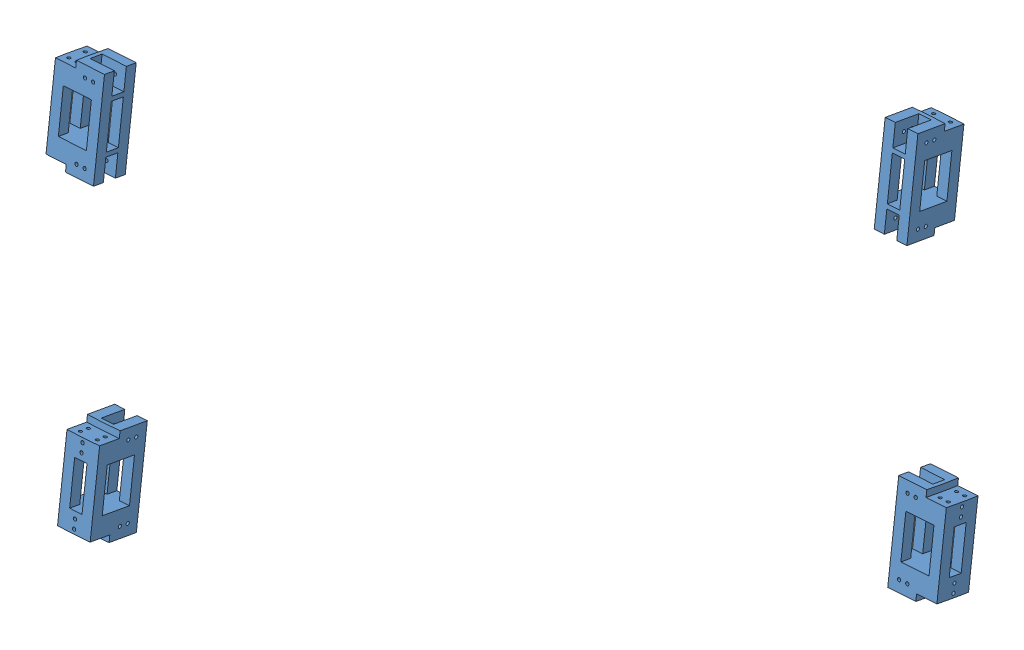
SolidWorks assembly SnapThroughAss_Circle.SLDASM, configuration Flap Out (file format 15000). Lengths in mm.
Overall size (441.77 122.34 441.02).
6 component instances, 2 part files, 96 mates.
Components (placement in the parent):
- Cage_wood_cuved_V02-5: Cage_wood_cuved_V02.SLDPRT [Plug] at (0 137.14 -6.6) (suppressed, hidden)
- Cage_wood_cuved_V02-3: Cage_wood_cuved_V02.SLDPRT [with Protection] at (6.6 137.14 0) x (0 0 -1) z (1 0 0) (suppressed, hidden)
- Cage_external_connection_V07-9: Cage_external_connection_V07.SLDPRT [Default] at (-183.5526 -85.2772 256.6106) x (0.002351 0.177811 0.984062) z (-0.998598 -0.051628 0.011714) size (24.01 44 16.1)
- Cage_external_connection_V07-10: Cage_external_connection_V07.SLDPRT [Default] at (-403.7618 -135.8123 42.37) x (-0.9986 -0.051894 0.010241) z (-0.000856 -0.177734 -0.984078) size (24.01 44 16.1)
- Cage_external_connection_V07-11: Cage_external_connection_V07.SLDPRT [Default] at (35.6207 -113.0961 37.2158) x (0.998593 0.051362 -0.013187) z (0.003845 0.177888 0.984043) size (24.01 44 16.1)
- Cage_external_connection_V07-12: Cage_external_connection_V07.SLDPRT [Default] at (-185.2445 -163.5479 -176.368) x (-0.00534 -0.177965 -0.984022) z (0.998586 0.051095 -0.01466) size (24.01 44 16.1)
Mates (geometry in assembly coordinates):
- Coincident1: coincident aligned: plane of Cage_wood_cuved_V02-1 through (0 137.14 -6.6) normal (1 0 0)
- Coincident2: coincident anti-aligned: plane of Cage_bottom_connection_S02-1 through (5.1 15 -5.1) normal (0 0 -1); plane of Cage_wood_cuved_V02-1 through (14 219.0483 -5.1) normal (0 0 1)
- Coincident3: coincident anti-aligned: plane of Cage_bottom_connection_S02-1 through (0 2 0) normal (0 1 0); plane of Cage_wood_cuved_V02-1 through (14 2 -5.1) normal (0 -1 0)
- Coincident4: coincident anti-aligned: plane of Cage_bottom_connection_S02-1 through (5.1 15 5.1) normal (0 0 1); plane of Cage_wood_cuved_V02-2 through (14 219.0483 5.1) normal (0 0 -1)
- Coincident5: coincident anti-aligned: plane of Cage_bottom_connection_S02-1 through (0 2 0) normal (0 1 0); plane of Cage_wood_cuved_V02-2 through (14 2 8.1) normal (0 -1 0)
- Coincident6: coincident aligned: plane of Cage_wood_cuved_V02-2 through (0 137.14 6.6) normal (1 0 0)
- Coincident7: coincident anti-aligned: plane of Cage_bottom_connection_S02-1 through (5.1 15 -5.1) normal (1 0 0); plane of Cage_wood_cuved_V02-3 through (5.1 219.0483 -14) normal (-1 0 0)
- Coincident8: coincident anti-aligned: plane of Cage_wood_cuved_V02-3 through (6.6 137.14 0) normal (0 0 -1)
- Coincident9: coincident anti-aligned: plane of Cage_bottom_connection_S02-1 through (0 2 0) normal (0 1 0); plane of Cage_wood_cuved_V02-3 through (8.1 2 -14) normal (0 -1 0)
- Coincident10: coincident aligned: plane of Cage_external_connection_V05-1 through (220 139.14 0) normal (0 0 1)
- Concentric1: concentric aligned: cylinder of Cage_wood_cuved_V02-1 through (209 134.14 -15.1) axis (0 0 1) radius 1.05; cylinder of Cage_external_connection_V05-1 through (209 134.14 -8.05) axis (0 0 1) radius 0.8
- Concentric2: concentric aligned: cylinder of Cage_wood_cuved_V02-1 through (206 131.14 -15.1) axis (0 0 1) radius 1.05; cylinder of Cage_external_connection_V05-1 through (206 131.14 -8.05) axis (0 0 1) radius 0.8
- Coincident11: coincident anti-aligned: plane of Cage_bottom_connection_S02-1 through (0 2 0) normal (0 -1 0); plane of Origami_SingleArm-1/Base-1 through (0 2 0) normal (0 1 0)
- Concentric3: concentric: cylinder of Cage_bottom_connection_S02-1 through (10 -0.001 0) axis (0 1 0) radius 0.65; cylinder of Origami_SingleArm-1/Base-1 through (9 3.85 0) axis (0 -1 0) radius 0.85
- Coincident13: coincident anti-aligned: plane of Cage_bottom_connection_S02-1 through (0 2 0) normal (0 1 0); plane of Rod_3mm-1 through (0 2 0) normal (0 -1 0)
- Concentric4: concentric anti-aligned: cylinder of Cage_bottom_connection_S02-1 through (0 -0.001 0) axis (0 1 0) radius 1.5; cylinder of Rod_3mm-1 through (0 139.46 0) axis (0 -1 0) radius 1.5
- Coincident14: coincident aligned: plane of Rod_3mm-1 through (0 2 0) normal (0 0 1)
- Concentric9: concentric aligned: cylinder of Rod_3mm-1 through (0 139.46 0) axis (0 -1 0) radius 1.5; cylinder of Connection-1 through (0 30.3595 0) axis (0 -1 0) radius 1.575
- Coincident15: coincident aligned: plane of Origami_SingleArm-1/Base-4 through (55.3 25.3595 0) normal (0 -1 0); plane of Connection-1 through (0 25.3595 0) normal (0 -1 0)
- Parallel3: parallel anti-aligned: plane of MG90S-1/Part3-1 through (-10 64.5257 -2.5) normal (0 -1 0)
- Parallel4: parallel aligned: plane of MG90S-1 through (15.5505 108.3581 -8.5) normal (0 0 1)
- Distance1: distance = 5 mm aligned: plane of MG90S-1/Part4-1 through (5 70.5257 -8.5) normal (1 0 0)
- Distance2: distance = 2.5 mm aligned: plane of MG90S-1/Part2-1 through (-3.5 64.5257 -2.5) normal (0 0 1)
- Concentric10: concentric aligned: cylinder of Rod_3mm-1 through (0 139.46 0) axis (0 -1 0) radius 1.5; cylinder of MotorMount-1 through (0 91.7757 0) axis (0 -1 0) radius 1.5
- Coincident20: coincident anti-aligned: plane of MotorMount-1 through (0 87.0257 0) normal (0 0 -1)
- Coincident21: coincident anti-aligned: plane of MG90S-1/Part2-1 through (-3.5 87.0257 -2.5) normal (0 1 0); plane of MotorMount-1 through (0 87.0257 0) normal (0 -1 0)
- Concentric11: concentric aligned: cylinder of Rod_3mm-1 through (0 139.46 0) axis (0 -1 0) radius 1.5; cylinder of MotorMount-2 through (0 64.5257 0) axis (0 -1 0) radius 1.5
- Coincident24: coincident aligned: plane of MotorMount-1 through (0 87.0257 0) normal (-1 0 0); plane of MotorMount-2 through (0 59.7757 0) normal (-1 0 0)
- Coincident26: coincident anti-aligned: plane of MG90S-1/Part2-1 through (-3.5 64.5257 -2.5) normal (0 -1 0); plane of MotorMount-2 through (0 64.5257 0) normal (0 1 0)
- Concentric12: concentric aligned: cylinder of Rod_3mm-1 through (0 139.46 0) axis (0 -1 0) radius 1.5; cylinder of Origami_printed_extension-1 through (0 31.2095 0) axis (0 -1 0) radius 1.575
- Concentric14: concentric aligned: cylinder of Origami_SingleArm-1/Base-4 through (0 26.2095 0) axis (0 -1 0) radius 1.575; cylinder of Rod_3mm-1 through (0 139.46 0) axis (0 -1 0) radius 1.5
- Concentric15: concentric aligned: cylinder of Origami_SingleArm-1/Base-4 through (3 26.2095 0) axis (0 -1 0) radius 0.375; cylinder of Origami_printed_extension-1 through (3 31.2095 0) axis (0 -1 0) radius 0.6
- Concentric16: concentric aligned: cylinder of Cage_bottom_connection_S02-1 through (5.3 6 0) axis (0 1 0) radius 1.5; cylinder of Origami_SingleArm-1/Base-1 through (5.3 1.15 0) axis (0 1 0) radius 1.5
- Concentric17: concentric aligned: cylinder of Cage_external_connection_V05-1 through (210.2197 134.9564 0) axis (0.915715 -0.401829 0) radius 0.8; cylinder of Origami_ExteriorAttachment-1/Origami_Exterior-2 through (213.4247 133.55 0) axis (0.915715 -0.401829 0) radius 1
- Concentric18: concentric aligned: cylinder of Cage_external_connection_V05-1 through (208.4114 130.8357 0) axis (0.915715 -0.401829 0) radius 0.8; cylinder of Origami_ExteriorAttachment-1/Origami_Exterior-2 through (211.6164 129.4293 0) axis (0.915715 -0.401829 0) radius 1
- Coincident28: coincident anti-aligned: plane of Cage_external_connection_V05-1 through (210.3686 126.5857 8.05) normal (0.915715 -0.401829 0); plane of Origami_ExteriorAttachment-1/Origami_Exterior-2 through (212.3196 131.0318 0) normal (-0.915715 0.401829 0)
- InPlace1: in place: plane of ? through (14 219.5483 5.1) normal (0 0 -1); plane of ? through (0 0 5.1) normal (0 0 -1); moOrthogonalPlaneRef_w of ? through (14 219.5483 5.1) normal (0 0 -1); plane of ? through (0 0 5.1) normal (0 1 0); plane of ? through (14 219.5483 5.1) normal (0 0 -1); plane of ? through (0 0 5.1) normal (-1 0 0); plane of ? through (14 219.0483 5.1) normal (0 0 -1); unknown of ?
- Coincident29: coincident aligned: plane of ?; plane of ?
- Coincident30: coincident aligned: moOrthogonalPlaneRef_w of Cage_wood_cuved_V02-2 through (0 137.14 5.1) normal (0 1 0); plane of Shield_side^SnapThroughAss-1 through (0 137.14 5.1) normal (0 1 0)
- Coincident31: coincident anti-aligned: moOrthogonalPlaneRef_w of Cage_wood_cuved_V02-2 through (0 137.14 5.1) normal (1 0 0); plane of Shield_side^SnapThroughAss-1 through (0 137.14 5.1) normal (-1 0 0)
- InPlace2: in place: plane of ? through (14 219.5483 5.1) normal (0 0 -1); plane of ? through (0 0 5.1) normal (0 0 -1); plane of ? through (14 219.5483 5.1) normal (0 0 -1); plane of ? through (0 0 5.1) normal (0 1 0); plane of ? through (14 219.5483 5.1) normal (0 0 -1); plane of ? through (0 0 5.1) normal (-1 0 0); plane of ? through (14 219.0483 5.1) normal (0 0 -1); unknown of ?
- Coincident32: coincident aligned: plane of ?; plane of ?
- Coincident33: coincident aligned: moOrthogonalPlaneRef_w of Cage_wood_cuved_V02-2 through (0 137.14 5.1) normal (0 1 0); plane of Shield_top-1 through (0 137.14 5.1) normal (0 1 0)
- Coincident34: coincident anti-aligned: moOrthogonalPlaneRef_w of Cage_wood_cuved_V02-2 through (0 137.14 5.1) normal (1 0 0); plane of Shield_top-1 through (0 137.14 5.1) normal (-1 0 0)
- Concentric21: concentric aligned: cylinder of Cage_bottom_connection_S02-1 through (13 11.5 -9.9) axis (-1 0 0) radius 0.75; cylinder of Cage_wood_cuved_V02-4 through (-5.099 11.5 -9.9) axis (-1 0 0) radius 0.9
- Concentric22: concentric aligned: cylinder of Cage_bottom_connection_S02-1 through (13 7.5 -9.9) axis (-1 0 0) radius 0.75; cylinder of Cage_wood_cuved_V02-4 through (-5.099 7.5 -9.9) axis (-1 0 0) radius 0.9
- Coincident36: coincident anti-aligned: plane of Cage_bottom_connection_S02-1 through (-5.1 15 -5.1) normal (-1 0 0); plane of Cage_wood_cuved_V02-4 through (-5.1 220.0483 -14) normal (1 0 0)
- Coincident37: coincident anti-aligned: plane of Cage_bottom_connection_S02-1 through (5.1 15 -5.1) normal (0 0 -1); plane of Cage_wood_cuved_V02-5 through (14 219.0483 -5.1) normal (0 0 1)
- Coincident39: coincident aligned: circle of Shield_side^SnapThroughAss-1; circle of High_friction_material-1
- Coincident41: coincident aligned: plane of Takeoff_station-4 through (0 0 0) normal (0 0 1)
- Coincident42: coincident aligned: plane of Takeoff_station-4 through (0 0 0) normal (1 0 0)
- Coincident43: coincident aligned: plane of Takeoff_station-4 through (0 0 0) normal (0 1 0)
- Concentric24: concentric aligned: cylinder of Cage_bottom_connection_S02-1 through (10.1 8.6 -1.1) axis (0 0 -1) radius 0.8; cylinder of Cage_wood_cuved_V02-5 through (10.1 8.6 -5.099) axis (0 0 -1) radius 1.05
- Concentric25: concentric aligned: cylinder of Cage_bottom_connection_S02-1 through (10.1 5 -1.1) axis (0 0 -1) radius 1.5; cylinder of Cage_wood_cuved_V02-5 through (10.1 5 -5.099) axis (0 0 -1) radius 1.05
- Coincident44: coincident aligned: plane of Shield_side^SnapThroughAss-1 through (0 137.14 5.1) normal (0 1 0); plane of Shield_side^SnapThroughAss-10 through (0.0432 137.14 -5) normal (0 1 0)
- InPlace3: in place: plane of assembly through (0 0 0) normal (0 0 1); plane of assembly through (0 0 0) normal (0 1 0); plane of assembly through (0 0 0) normal (1 0 0); unknown of assembly
- Coincident45: coincident aligned: 
- Coincident46: coincident aligned: plane of Flap-1 through (0 0 0) normal (0 1 0)
- Coincident47: coincident anti-aligned: plane of Flap-1 through (0 0 0) normal (1 0 0)
- Coincident45: coincident anti-aligned: plane of Origami_SingleArm-1/Base-4 through (55.3 26.2095 0) normal (0 1 0); plane of Origami_printed_extension-1 through (0 26.2095 0) normal (0 -1 0)
- Coincident49: coincident aligned: plane of Origami_printed_extension-1 through (0 31.2095 0) normal (0 1 0); plane of Spring-1 through (0 31.2095 0) normal (0 1 0)
- Coincident50: coincident anti-aligned: plane of Spring-1 through (0 31.2095 0) normal (0 0 -1)
- Coincident51: coincident aligned: plane of Origami_printed_extension-1 through (0 26.2095 0) normal (1 0 0); plane of Spring-1 through (0 31.2095 0) normal (1 0 0)
- Concentric26: concentric aligned: cylinder of Cage_wood_cuved_V04-7 through (10.1 -132.14 -11.699) axis (0 0 -1) radius 1.05; cylinder of Cage_bottom_connection_S03-2 through (10.1 -132.14 -7.7) axis (0 0 -1) radius 1.5
- Coincident52: coincident anti-aligned: plane of Cage_wood_cuved_V04-7 through (14 81.9083 -11.7) normal (0 0 1); plane of Cage_bottom_connection_S03-2 through (5.1 -122.14 -11.7) normal (0 0 -1)
- Concentric27: concentric anti-aligned: cylinder of Cage_wood_cuved_V04-1 through (8.101 -128.54 -16.7) axis (-1 0 0) radius 1.05; cylinder of Cage_bottom_connection_S03-2 through (1.1 -128.54 -16.7) axis (1 0 0) radius 0.8
- Coincident53: coincident anti-aligned: plane of Cage_wood_cuved_V04-1 through (5.1 81.9083 -20.6) normal (-1 0 0); plane of Cage_bottom_connection_S03-2 through (5.1 -122.14 -11.7) normal (1 0 0)
- Coincident60: coincident anti-aligned: plane of Cage_wood_cuved_V04-8 through (-5.1 81.9083 -20.6) normal (1 0 0); plane of Cage_bottom_connection_S03-2 through (-5.1 -122.14 -11.7) normal (-1 0 0)
- Concentric30: concentric aligned: cylinder of Cage_wood_cuved_V04-8 through (-5.099 -132.14 -16.7) axis (-1 0 0) radius 1.05; cylinder of Cage_bottom_connection_S03-2 through (-1.1 -132.14 -16.7) axis (-1 0 0) radius 1.5
- Coincident61: coincident anti-aligned: plane of Cage_wood_cuved_V04-5 through (-14 81.9083 -11.7) normal (0 0 1); plane of Cage_bottom_connection_S03-2 through (-5.1 -122.14 -11.7) normal (0 0 -1)
- Concentric31: concentric anti-aligned: cylinder of Cage_wood_cuved_V04-5 through (-10.1 -128.54 -14.701) axis (0 0 1) radius 1.05; cylinder of Cage_bottom_connection_S03-2 through (-10.1 -128.54 -7.7) axis (0 0 -1) radius 0.8
- Coincident62: coincident anti-aligned: plane of Cage_wood_cuved_V04-5 through (-5.1 -122.14 -14.7) normal (1 0 0); plane of Cage_bottom_connection_S03-2 through (-5.1 -122.14 -11.7) normal (-1 0 0)
- Coincident63: coincident anti-aligned: plane of Cage_wood_cuved_V04-3 through (14 81.9083 -1.5) normal (0 0 -1); plane of Cage_bottom_connection_S03-2 through (5.1 -122.14 -1.5) normal (0 0 1)
- Concentric32: concentric anti-aligned: cylinder of Cage_wood_cuved_V04-3 through (10.1 -128.54 1.501) axis (0 0 -1) radius 1.05; cylinder of Cage_bottom_connection_S03-2 through (10.1 -128.54 -5.5) axis (0 0 1) radius 0.8
- Coincident64: coincident anti-aligned: plane of Cage_wood_cuved_V04-3 through (5.1 -122.14 1.5) normal (-1 0 0); plane of Cage_bottom_connection_S03-2 through (5.1 -122.14 -1.5) normal (1 0 0)
- Coincident65: coincident anti-aligned: plane of Cage_wood_cuved_V04-2 through (5.1 81.9083 7.4) normal (-1 0 0); plane of Cage_bottom_connection_S03-2 through (5.1 -122.14 -1.5) normal (1 0 0)
- Concentric33: concentric aligned: cylinder of Cage_wood_cuved_V04-2 through (5.099 -132.14 3.5) axis (1 0 0) radius 1.05; cylinder of Cage_bottom_connection_S03-2 through (1.1 -132.14 3.5) axis (1 0 0) radius 1.5
- Coincident66: coincident anti-aligned: plane of Cage_wood_cuved_V04-4 through (-5.1 81.9083 7.4) normal (1 0 0); plane of Cage_bottom_connection_S03-2 through (-5.1 -122.14 -1.5) normal (-1 0 0)
- Concentric34: concentric anti-aligned: cylinder of Cage_wood_cuved_V04-4 through (-8.101 -128.54 3.5) axis (1 0 0) radius 1.05; cylinder of Cage_bottom_connection_S03-2 through (-1.1 -128.54 3.5) axis (-1 0 0) radius 0.8
- Coincident67: coincident anti-aligned: plane of Cage_wood_cuved_V04-4 through (-8.1 -122.14 -1.5) normal (0 0 -1); plane of Cage_bottom_connection_S03-2 through (-5.1 -122.14 -1.5) normal (0 0 1)
- Coincident68: coincident anti-aligned: plane of Cage_wood_cuved_V04-9 through (-14 81.9083 -1.5) normal (0 0 -1); plane of Cage_bottom_connection_S03-2 through (-5.1 -122.14 -1.5) normal (0 0 1)
- Concentric35: concentric aligned: cylinder of Cage_wood_cuved_V04-9 through (-10.1 -132.14 -1.501) axis (0 0 1) radius 1.05; cylinder of Cage_bottom_connection_S03-2 through (-10.1 -132.14 -5.5) axis (0 0 1) radius 1.5
- Coincident69: coincident anti-aligned: plane of Cage_wood_cuved_V04-9 through (-5.1 -122.14 -1.5) normal (1 0 0); plane of Cage_bottom_connection_S03-2 through (-5.1 -122.14 -1.5) normal (-1 0 0)
- Concentric36: concentric aligned: cylinder of Cage_wood_cuved_V04-3 through (209 -3 -8.5) axis (0 0 1) radius 1.05; cylinder of Cage_external_connection_V05-5 through (209 -3 -14.725) axis (0 0 1) radius 0.8
- Coincident70: coincident anti-aligned: plane of Cage_wood_cuved_V04-7 through (14 81.9083 -11.7) normal (0 0 1); plane of Cage_external_connection_V05-5 through (220 2 -11.7) normal (0 0 -1)
- Coincident71: coincident anti-aligned: plane of Cage_wood_cuved_V04-7 through (200.887 0 -11.7) normal (0 1 0); plane of Cage_external_connection_V06-5 through (220 0 -6.675) normal (0 -1 0)
- Concentric37: concentric aligned: cylinder of Cage_wood_cuved_V04-5 through (-209 -3 -4.7) axis (0 0 -1) radius 1.05; cylinder of Cage_external_connection_V05-6 through (-209 -3 1.375) axis (0 0 -1) radius 0.8
- Coincident72: coincident anti-aligned: plane of Cage_wood_cuved_V04-5 through (-14 81.9083 -11.7) normal (0 0 1); plane of Cage_external_connection_V05-6 through (-220 2 -11.7) normal (0 0 -1)
- Coincident73: coincident anti-aligned: plane of Cage_wood_cuved_V04-9 through (-200.887 0 -1.5) normal (0 1 0); plane of Cage_external_connection_V06-6 through (-220 0 -6.675) normal (0 -1 0)
- Coincident74: coincident anti-aligned: plane of Cage_wood_cuved_V04-2 through (5.1 81.9083 7.4) normal (-1 0 0); plane of Cage_external_connection_V05-7 through (5.1 2 213.4) normal (1 0 0)
- Concentric38: concentric aligned: cylinder of Cage_wood_cuved_V04-2 through (15.1 -3 202.4) axis (-1 0 0) radius 1.05; cylinder of Cage_external_connection_V05-7 through (8.125 -3 202.4) axis (-1 0 0) radius 0.8
- Coincident75: coincident anti-aligned: plane of Cage_wood_cuved_V04-4 through (-8.1 0 194.287) normal (0 1 0); plane of Cage_external_connection_V06-7 through (0.075 0 213.4) normal (0 -1 0)
- Coincident80: coincident anti-aligned: plane of Cage_wood_cuved_V04-8 through (-5.1 81.9083 -20.6) normal (1 0 0); plane of Cage_external_connection_V05-8 through (-5.1 2 -226.6) normal (-1 0 0)
- Coincident81: coincident anti-aligned: plane of Cage_wood_cuved_V04-1 through (8.1 0 -207.487) normal (0 1 0); plane of Cage_external_connection_V06-8 through (8.2137 2.3601 -222.8793) normal (-0.015244 0.949239 0.314186)
- Concentric40: concentric aligned: cylinder of Cage_wood_cuved_V04-1 through (-1.9 -3 -215.6) axis (1 0 0) radius 1.05; cylinder of Cage_external_connection_V05-8 through (-8.125 -3 -215.6) axis (1 0 0) radius 0.8
- Concentric41: concentric aligned: cylinder of Cage_wood_cuved_V04-8 through (-15.1 -3 -215.6) axis (1 0 0) radius 1.05; cylinder of Cage_external_connection_V05-8 through (-8.125 -3 -215.6) axis (1 0 0) radius 0.8
